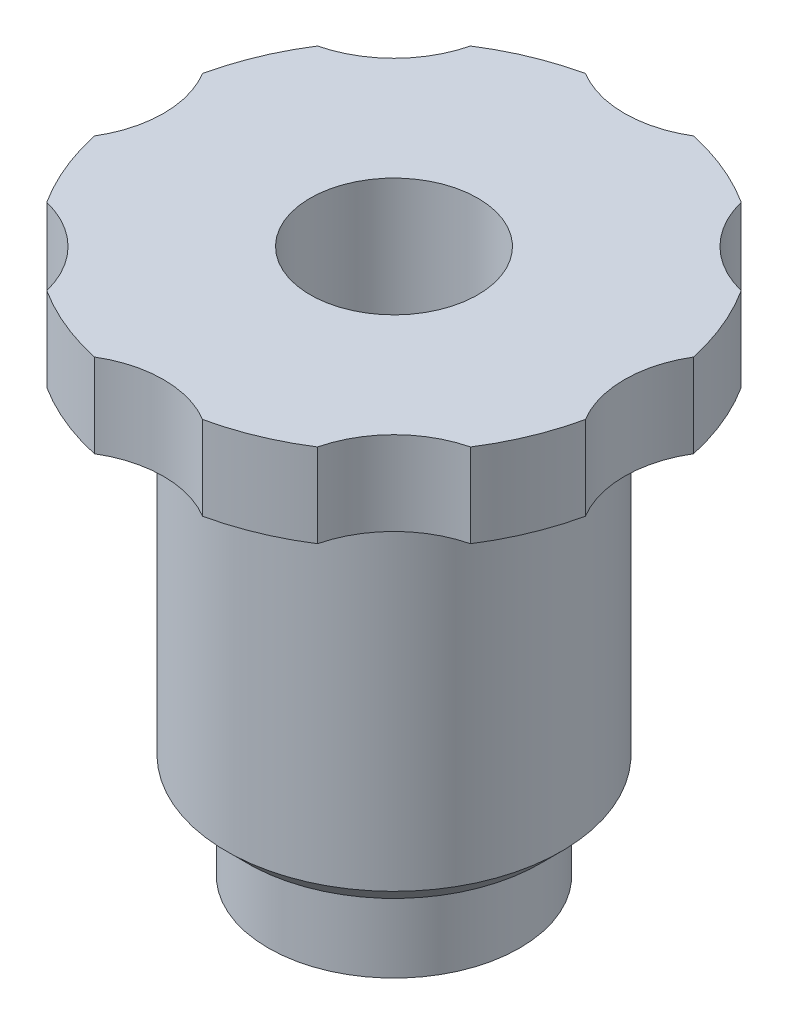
ISO-10303-21;
HEADER;
FILE_DESCRIPTION(('STEP AP214'),'2;1');
FILE_NAME('part.step','',(''),(''),'','','');
FILE_SCHEMA(('AUTOMOTIVE_DESIGN { 1 0 10303 214 1 1 1 1 }'));
ENDSEC;
DATA;
#1=APPLICATION_CONTEXT('core data for automotive mechanical design processes');
#2=APPLICATION_PROTOCOL_DEFINITION('international standard','automotive_design',2000,#1);
#3=PRODUCT_CONTEXT('',#1,'mechanical');
#4=PRODUCT('Part','Part','',(#3));
#5=PRODUCT_RELATED_PRODUCT_CATEGORY('part','',(#4));
#6=PRODUCT_DEFINITION_FORMATION('','',#4);
#7=PRODUCT_DEFINITION_CONTEXT('part definition',#1,'design');
#8=PRODUCT_DEFINITION('design','',#6,#7);
#9=PRODUCT_DEFINITION_SHAPE('','',#8);
#10=(LENGTH_UNIT() NAMED_UNIT(*) SI_UNIT(.MILLI.,.METRE.));
#11=(NAMED_UNIT(*) PLANE_ANGLE_UNIT() SI_UNIT($,.RADIAN.));
#12=(NAMED_UNIT(*) SI_UNIT($,.STERADIAN.) SOLID_ANGLE_UNIT());
#13=UNCERTAINTY_MEASURE_WITH_UNIT(LENGTH_MEASURE(1.E-05),#10,'distance_accuracy_value','');
#14=(GEOMETRIC_REPRESENTATION_CONTEXT(3) GLOBAL_UNCERTAINTY_ASSIGNED_CONTEXT((#13)) GLOBAL_UNIT_ASSIGNED_CONTEXT((#10,
#11,#12)) REPRESENTATION_CONTEXT('',''));
#15=CARTESIAN_POINT('',(0.,0.,0.));
#16=DIRECTION('',(0.,0.,1.));
#17=DIRECTION('',(1.,0.,0.));
#18=AXIS2_PLACEMENT_3D('',#15,#16,#17);
#19=CARTESIAN_POINT('',(0.,0.,0.));
#20=DIRECTION('',(0.,-1.,0.));
#21=DIRECTION('',(0.,0.,-1.));
#22=AXIS2_PLACEMENT_3D('',#19,#20,#21);
#23=CYLINDRICAL_SURFACE('',#22,6.);
#24=DIRECTION('',(0.,1.,0.));
#25=VECTOR('',#24,1.);
#26=CARTESIAN_POINT('',(5.05636440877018,6.49999999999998,-3.23004318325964));
#27=LINE('',#26,#25);
#28=CARTESIAN_POINT('',(5.05636440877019,13.,-3.23004318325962));
#29=VERTEX_POINT('',#28);
#30=CARTESIAN_POINT('',(5.05636440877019,11.,-3.23004318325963));
#31=VERTEX_POINT('',#30);
#32=EDGE_CURVE('E145',#29,#31,#27,.F.);
#33=ORIENTED_EDGE('',*,*,#32,.F.);
#34=CARTESIAN_POINT('',(0.,13.0000000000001,0.));
#35=DIRECTION('',(0.,-1.,0.));
#36=DIRECTION('',(0.,0.,-1.));
#37=AXIS2_PLACEMENT_3D('',#34,#35,#36);
#38=CIRCLE('',#37,6.);
#39=CARTESIAN_POINT('',(5.85937499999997,13.,-1.29140412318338));
#40=VERTEX_POINT('',#39);
#41=EDGE_CURVE('E156',#29,#40,#38,.T.);
#42=ORIENTED_EDGE('',*,*,#41,.T.);
#43=DIRECTION('',(0.,1.,0.));
#44=VECTOR('',#43,1.);
#45=CARTESIAN_POINT('',(5.859375,6.49999999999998,-1.29140412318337));
#46=LINE('',#45,#44);
#47=CARTESIAN_POINT('',(5.859375,11.,-1.29140412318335));
#48=VERTEX_POINT('',#47);
#49=EDGE_CURVE('E263',#48,#40,#46,.T.);
#50=ORIENTED_EDGE('',*,*,#49,.F.);
#51=CARTESIAN_POINT('',(0.,11.,0.));
#52=DIRECTION('',(0.,-1.,0.));
#53=DIRECTION('',(0.,0.,-1.));
#54=AXIS2_PLACEMENT_3D('',#51,#52,#53);
#55=CIRCLE('',#54,6.);
#56=EDGE_CURVE('E158',#31,#48,#55,.T.);
#57=ORIENTED_EDGE('',*,*,#56,.F.);
#58=EDGE_LOOP('',(#33,#42,#50,#57));
#59=FACE_BOUND('',#58,.T.);
#60=ADVANCED_FACE('F32',(#59),#23,.T.);
#61=DIRECTION('',(0.,1.,0.));
#62=VECTOR('',#61,1.);
#63=CARTESIAN_POINT('',(3.23004318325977,6.50000000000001,-5.05636440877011));
#64=LINE('',#63,#62);
#65=CARTESIAN_POINT('',(3.23004318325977,11.,-5.0563644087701));
#66=VERTEX_POINT('',#65);
#67=CARTESIAN_POINT('',(3.23004318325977,13.,-5.05636440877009));
#68=VERTEX_POINT('',#67);
#69=EDGE_CURVE('E47',#66,#68,#64,.T.);
#70=ORIENTED_EDGE('',*,*,#69,.F.);
#71=CARTESIAN_POINT('',(1.29140412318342,11.,-5.85937499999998));
#72=VERTEX_POINT('',#71);
#73=EDGE_CURVE('E180',#72,#66,#55,.T.);
#74=ORIENTED_EDGE('',*,*,#73,.F.);
#75=DIRECTION('',(0.,1.,0.));
#76=VECTOR('',#75,1.);
#77=CARTESIAN_POINT('',(1.29140412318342,6.50000000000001,-5.85937499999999));
#78=LINE('',#77,#76);
#79=CARTESIAN_POINT('',(1.29140412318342,13.,-5.85937499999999));
#80=VERTEX_POINT('',#79);
#81=EDGE_CURVE('E222',#80,#72,#78,.F.);
#82=ORIENTED_EDGE('',*,*,#81,.F.);
#83=EDGE_CURVE('E166',#80,#68,#38,.T.);
#84=ORIENTED_EDGE('',*,*,#83,.T.);
#85=EDGE_LOOP('',(#70,#74,#82,#84));
#86=FACE_BOUND('',#85,.T.);
#87=ADVANCED_FACE('F325',(#86),#23,.T.);
#88=DIRECTION('',(0.,1.,0.));
#89=VECTOR('',#88,1.);
#90=CARTESIAN_POINT('',(-1.29140412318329,6.50000000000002,-5.859375));
#91=LINE('',#90,#89);
#92=CARTESIAN_POINT('',(-1.29140412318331,11.,-5.859375));
#93=VERTEX_POINT('',#92);
#94=CARTESIAN_POINT('',(-1.2914041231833,13.,-5.85937499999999));
#95=VERTEX_POINT('',#94);
#96=EDGE_CURVE('E55',#93,#95,#91,.T.);
#97=ORIENTED_EDGE('',*,*,#96,.F.);
#98=CARTESIAN_POINT('',(-3.23004318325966,11.,-5.05636440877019));
#99=VERTEX_POINT('',#98);
#100=EDGE_CURVE('E316',#99,#93,#55,.T.);
#101=ORIENTED_EDGE('',*,*,#100,.F.);
#102=DIRECTION('',(0.,1.,0.));
#103=VECTOR('',#102,1.);
#104=CARTESIAN_POINT('',(-3.23004318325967,6.50000000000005,-5.05636440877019));
#105=LINE('',#104,#103);
#106=CARTESIAN_POINT('',(-3.23004318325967,13.,-5.05636440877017));
#107=VERTEX_POINT('',#106);
#108=EDGE_CURVE('E212',#107,#99,#105,.F.);
#109=ORIENTED_EDGE('',*,*,#108,.F.);
#110=EDGE_CURVE('E170',#107,#95,#38,.T.);
#111=ORIENTED_EDGE('',*,*,#110,.T.);
#112=EDGE_LOOP('',(#97,#101,#109,#111));
#113=FACE_BOUND('',#112,.T.);
#114=ADVANCED_FACE('F209',(#113),#23,.T.);
#115=DIRECTION('',(0.,1.,0.));
#116=VECTOR('',#115,1.);
#117=CARTESIAN_POINT('',(-5.05636440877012,6.49999999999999,-3.23004318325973));
#118=LINE('',#117,#116);
#119=CARTESIAN_POINT('',(-5.05636440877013,11.,-3.23004318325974));
#120=VERTEX_POINT('',#119);
#121=CARTESIAN_POINT('',(-5.05636440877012,13.,-3.23004318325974));
#122=VERTEX_POINT('',#121);
#123=EDGE_CURVE('E227',#120,#122,#118,.T.);
#124=ORIENTED_EDGE('',*,*,#123,.F.);
#125=CARTESIAN_POINT('',(-5.85937499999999,11.0000000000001,-1.29140412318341));
#126=VERTEX_POINT('',#125);
#127=EDGE_CURVE('E312',#126,#120,#55,.T.);
#128=ORIENTED_EDGE('',*,*,#127,.F.);
#129=DIRECTION('',(0.,1.,0.));
#130=VECTOR('',#129,1.);
#131=CARTESIAN_POINT('',(-5.85937499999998,6.50000000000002,-1.29140412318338));
#132=LINE('',#131,#130);
#133=CARTESIAN_POINT('',(-5.85937499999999,13.,-1.2914041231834));
#134=VERTEX_POINT('',#133);
#135=EDGE_CURVE('E236',#134,#126,#132,.F.);
#136=ORIENTED_EDGE('',*,*,#135,.F.);
#137=EDGE_CURVE('E195',#134,#122,#38,.T.);
#138=ORIENTED_EDGE('',*,*,#137,.T.);
#139=EDGE_LOOP('',(#124,#128,#136,#138));
#140=FACE_BOUND('',#139,.T.);
#141=ADVANCED_FACE('F364',(#140),#23,.T.);
#142=DIRECTION('',(0.,1.,0.));
#143=VECTOR('',#142,1.);
#144=CARTESIAN_POINT('',(-5.85937500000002,6.50000000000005,1.29140412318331));
#145=LINE('',#144,#143);
#146=CARTESIAN_POINT('',(-5.85937500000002,11.,1.29140412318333));
#147=VERTEX_POINT('',#146);
#148=CARTESIAN_POINT('',(-5.859375,13.,1.29140412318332));
#149=VERTEX_POINT('',#148);
#150=EDGE_CURVE('E234',#147,#149,#145,.T.);
#151=ORIENTED_EDGE('',*,*,#150,.F.);
#152=CARTESIAN_POINT('',(-5.05636440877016,11.,3.23004318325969));
#153=VERTEX_POINT('',#152);
#154=EDGE_CURVE('E308',#153,#147,#55,.T.);
#155=ORIENTED_EDGE('',*,*,#154,.F.);
#156=DIRECTION('',(0.,1.,0.));
#157=VECTOR('',#156,1.);
#158=CARTESIAN_POINT('',(-5.05636440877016,6.50000000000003,3.23004318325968));
#159=LINE('',#158,#157);
#160=CARTESIAN_POINT('',(-5.05636440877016,13.0000000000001,3.23004318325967));
#161=VERTEX_POINT('',#160);
#162=EDGE_CURVE('E244',#161,#153,#159,.F.);
#163=ORIENTED_EDGE('',*,*,#162,.F.);
#164=EDGE_CURVE('E189',#161,#149,#38,.T.);
#165=ORIENTED_EDGE('',*,*,#164,.T.);
#166=EDGE_LOOP('',(#151,#155,#163,#165));
#167=FACE_BOUND('',#166,.T.);
#168=ADVANCED_FACE('F354',(#167),#23,.T.);
#169=DIRECTION('',(0.,1.,0.));
#170=VECTOR('',#169,1.);
#171=CARTESIAN_POINT('',(-3.23004318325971,6.50000000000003,5.05636440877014));
#172=LINE('',#171,#170);
#173=CARTESIAN_POINT('',(-3.23004318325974,11.0000000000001,5.05636440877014));
#174=VERTEX_POINT('',#173);
#175=CARTESIAN_POINT('',(-3.23004318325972,13.,5.05636440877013));
#176=VERTEX_POINT('',#175);
#177=EDGE_CURVE('E242',#174,#176,#172,.T.);
#178=ORIENTED_EDGE('',*,*,#177,.F.);
#179=CARTESIAN_POINT('',(-1.29140412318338,11.,5.85937499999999));
#180=VERTEX_POINT('',#179);
#181=EDGE_CURVE('E304',#180,#174,#55,.T.);
#182=ORIENTED_EDGE('',*,*,#181,.F.);
#183=DIRECTION('',(0.,1.,0.));
#184=VECTOR('',#183,1.);
#185=CARTESIAN_POINT('',(-1.29140412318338,6.50000000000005,5.859375));
#186=LINE('',#185,#184);
#187=CARTESIAN_POINT('',(-1.29140412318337,13.0000000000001,5.85937499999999));
#188=VERTEX_POINT('',#187);
#189=EDGE_CURVE('E252',#188,#180,#186,.F.);
#190=ORIENTED_EDGE('',*,*,#189,.F.);
#191=EDGE_CURVE('E183',#188,#176,#38,.T.);
#192=ORIENTED_EDGE('',*,*,#191,.T.);
#193=EDGE_LOOP('',(#178,#182,#190,#192));
#194=FACE_BOUND('',#193,.T.);
#195=ADVANCED_FACE('F351',(#194),#23,.T.);
#196=DIRECTION('',(0.,1.,0.));
#197=VECTOR('',#196,1.);
#198=CARTESIAN_POINT('',(1.29140412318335,6.50000000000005,5.85937500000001));
#199=LINE('',#198,#197);
#200=CARTESIAN_POINT('',(1.29140412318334,11.0000000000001,5.85937500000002));
#201=VERTEX_POINT('',#200);
#202=CARTESIAN_POINT('',(1.29140412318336,13.0000000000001,5.859375));
#203=VERTEX_POINT('',#202);
#204=EDGE_CURVE('E250',#201,#203,#199,.T.);
#205=ORIENTED_EDGE('',*,*,#204,.F.);
#206=CARTESIAN_POINT('',(3.2300431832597,11.,5.05636440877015));
#207=VERTEX_POINT('',#206);
#208=EDGE_CURVE('E298',#207,#201,#55,.T.);
#209=ORIENTED_EDGE('',*,*,#208,.F.);
#210=DIRECTION('',(0.,1.,0.));
#211=VECTOR('',#210,1.);
#212=CARTESIAN_POINT('',(3.23004318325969,6.50000000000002,5.05636440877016));
#213=LINE('',#212,#211);
#214=CARTESIAN_POINT('',(3.23004318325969,13.,5.05636440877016));
#215=VERTEX_POINT('',#214);
#216=EDGE_CURVE('E260',#215,#207,#213,.F.);
#217=ORIENTED_EDGE('',*,*,#216,.F.);
#218=EDGE_CURVE('E176',#215,#203,#38,.T.);
#219=ORIENTED_EDGE('',*,*,#218,.T.);
#220=EDGE_LOOP('',(#205,#209,#217,#219));
#221=FACE_BOUND('',#220,.T.);
#222=ADVANCED_FACE('F278',(#221),#23,.T.);
#223=CARTESIAN_POINT('',(0.,0.,0.));
#224=DIRECTION('',(0.,-1.,0.));
#225=DIRECTION('',(0.,0.,-1.));
#226=AXIS2_PLACEMENT_3D('',#223,#224,#225);
#227=PLANE('',#226);
#228=CARTESIAN_POINT('',(0.,0.,0.));
#229=DIRECTION('',(0.,-1.,0.));
#230=DIRECTION('',(0.,0.,-1.));
#231=AXIS2_PLACEMENT_3D('',#228,#229,#230);
#232=CIRCLE('',#231,2.);
#233=CARTESIAN_POINT('',(0.,0.,-1.99999999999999));
#234=VERTEX_POINT('',#233);
#235=EDGE_CURVE('E172',#234,#234,#232,.T.);
#236=ORIENTED_EDGE('',*,*,#235,.F.);
#237=EDGE_LOOP('',(#236));
#238=FACE_BOUND('',#237,.T.);
#239=CARTESIAN_POINT('',(0.,0.,0.));
#240=DIRECTION('',(0.,-1.,0.));
#241=DIRECTION('',(0.,0.,-1.));
#242=AXIS2_PLACEMENT_3D('',#239,#240,#241);
#243=CIRCLE('',#242,3.);
#244=CARTESIAN_POINT('',(0.,0.,-3.00000000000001));
#245=VERTEX_POINT('',#244);
#246=EDGE_CURVE('E281',#245,#245,#243,.T.);
#247=ORIENTED_EDGE('',*,*,#246,.T.);
#248=EDGE_LOOP('',(#247));
#249=FACE_BOUND('',#248,.T.);
#250=ADVANCED_FACE('F34',(#238,#249),#227,.T.);
#251=CARTESIAN_POINT('',(0.,0.,0.));
#252=DIRECTION('',(0.,-1.,0.));
#253=DIRECTION('',(0.,0.,-1.));
#254=AXIS2_PLACEMENT_3D('',#251,#252,#253);
#255=CYLINDRICAL_SURFACE('',#254,3.);
#256=CARTESIAN_POINT('',(0.,2.00000000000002,0.));
#257=DIRECTION('',(0.,-1.,0.));
#258=DIRECTION('',(0.,0.,-1.));
#259=AXIS2_PLACEMENT_3D('',#256,#257,#258);
#260=CIRCLE('',#259,3.);
#261=CARTESIAN_POINT('',(0.,2.00000000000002,-3.00000000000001));
#262=VERTEX_POINT('',#261);
#263=EDGE_CURVE('E283',#262,#262,#260,.T.);
#264=CARTESIAN_POINT('',(0.,2.00000000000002,-3.00000000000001));
#265=CARTESIAN_POINT('',(0.,1.97916666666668,-3.00000000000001));
#266=CARTESIAN_POINT('',(0.,1.95833333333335,-3.00000000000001));
#267=CARTESIAN_POINT('',(0.,1.91666666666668,-3.00000000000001));
#268=CARTESIAN_POINT('',(0.,1.89583333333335,-3.00000000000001));
#269=CARTESIAN_POINT('',(0.,1.85416666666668,-3.00000000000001));
#270=CARTESIAN_POINT('',(0.,1.83333333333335,-3.00000000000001));
#271=CARTESIAN_POINT('',(0.,1.79166666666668,-3.00000000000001));
#272=CARTESIAN_POINT('',(0.,1.77083333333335,-3.00000000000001));
#273=CARTESIAN_POINT('',(0.,1.72916666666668,-3.00000000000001));
#274=CARTESIAN_POINT('',(0.,1.70833333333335,-3.00000000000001));
#275=CARTESIAN_POINT('',(0.,1.66666666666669,-3.00000000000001));
#276=CARTESIAN_POINT('',(0.,1.64583333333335,-3.00000000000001));
#277=CARTESIAN_POINT('',(0.,1.60416666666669,-3.00000000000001));
#278=CARTESIAN_POINT('',(0.,1.58333333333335,-3.00000000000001));
#279=CARTESIAN_POINT('',(0.,1.54166666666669,-3.00000000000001));
#280=CARTESIAN_POINT('',(0.,1.52083333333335,-3.00000000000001));
#281=CARTESIAN_POINT('',(0.,1.47916666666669,-3.00000000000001));
#282=CARTESIAN_POINT('',(0.,1.45833333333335,-3.00000000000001));
#283=CARTESIAN_POINT('',(0.,1.41666666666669,-3.00000000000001));
#284=CARTESIAN_POINT('',(0.,1.39583333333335,-3.00000000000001));
#285=CARTESIAN_POINT('',(0.,1.35416666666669,-3.00000000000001));
#286=CARTESIAN_POINT('',(0.,1.33333333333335,-3.00000000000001));
#287=CARTESIAN_POINT('',(0.,1.29166666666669,-3.00000000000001));
#288=CARTESIAN_POINT('',(0.,1.27083333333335,-3.00000000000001));
#289=CARTESIAN_POINT('',(0.,1.22916666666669,-3.00000000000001));
#290=CARTESIAN_POINT('',(0.,1.20833333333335,-3.00000000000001));
#291=CARTESIAN_POINT('',(0.,1.16666666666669,-3.00000000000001));
#292=CARTESIAN_POINT('',(0.,1.14583333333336,-3.00000000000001));
#293=CARTESIAN_POINT('',(0.,1.10416666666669,-3.00000000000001));
#294=CARTESIAN_POINT('',(0.,1.08333333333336,-3.00000000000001));
#295=CARTESIAN_POINT('',(0.,1.04166666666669,-3.00000000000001));
#296=CARTESIAN_POINT('',(0.,1.02083333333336,-3.00000000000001));
#297=CARTESIAN_POINT('',(0.,0.979166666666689,-3.00000000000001));
#298=CARTESIAN_POINT('',(0.,0.958333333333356,-3.00000000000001));
#299=CARTESIAN_POINT('',(0.,0.91666666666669,-3.00000000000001));
#300=CARTESIAN_POINT('',(0.,0.895833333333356,-3.00000000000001));
#301=CARTESIAN_POINT('',(0.,0.85416666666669,-3.00000000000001));
#302=CARTESIAN_POINT('',(0.,0.833333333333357,-3.00000000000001));
#303=CARTESIAN_POINT('',(0.,0.79166666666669,-3.00000000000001));
#304=CARTESIAN_POINT('',(0.,0.770833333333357,-3.00000000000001));
#305=CARTESIAN_POINT('',(0.,0.729166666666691,-3.00000000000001));
#306=CARTESIAN_POINT('',(0.,0.708333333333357,-3.00000000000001));
#307=CARTESIAN_POINT('',(0.,0.666666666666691,-3.00000000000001));
#308=CARTESIAN_POINT('',(0.,0.645833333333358,-3.00000000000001));
#309=CARTESIAN_POINT('',(0.,0.604166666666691,-3.00000000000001));
#310=CARTESIAN_POINT('',(0.,0.583333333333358,-3.00000000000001));
#311=CARTESIAN_POINT('',(0.,0.541666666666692,-3.00000000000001));
#312=CARTESIAN_POINT('',(0.,0.520833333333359,-3.00000000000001));
#313=CARTESIAN_POINT('',(0.,0.479166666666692,-3.00000000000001));
#314=CARTESIAN_POINT('',(0.,0.458333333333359,-3.00000000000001));
#315=CARTESIAN_POINT('',(0.,0.416666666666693,-3.00000000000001));
#316=CARTESIAN_POINT('',(0.,0.395833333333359,-3.00000000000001));
#317=CARTESIAN_POINT('',(0.,0.354166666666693,-3.00000000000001));
#318=CARTESIAN_POINT('',(0.,0.33333333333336,-3.00000000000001));
#319=CARTESIAN_POINT('',(0.,0.291666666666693,-3.00000000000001));
#320=CARTESIAN_POINT('',(0.,0.27083333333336,-3.00000000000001));
#321=CARTESIAN_POINT('',(0.,0.229166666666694,-3.00000000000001));
#322=CARTESIAN_POINT('',(0.,0.20833333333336,-3.00000000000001));
#323=CARTESIAN_POINT('',(0.,0.166666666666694,-3.00000000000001));
#324=CARTESIAN_POINT('',(0.,0.145833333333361,-3.00000000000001));
#325=CARTESIAN_POINT('',(0.,0.104166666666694,-3.00000000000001));
#326=CARTESIAN_POINT('',(0.,0.0833333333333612,-3.00000000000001));
#327=CARTESIAN_POINT('',(0.,0.0416666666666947,-3.00000000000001));
#328=CARTESIAN_POINT('',(0.,0.0208333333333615,-3.00000000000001));
#329=CARTESIAN_POINT('',(0.,0.,-3.00000000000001));
#330=B_SPLINE_CURVE_WITH_KNOTS('',3,(#264,#265,#266,#267,#268,#269,#270,#271,#272,#273,#274,
#275,#276,#277,#278,#279,#280,#281,#282,#283,#284,#285,#286,#287,#288,#289,#290,#291,#292,#293,
#294,#295,#296,#297,#298,#299,#300,#301,#302,#303,#304,#305,#306,#307,#308,#309,#310,#311,#312,
#313,#314,#315,#316,#317,#318,#319,#320,#321,#322,#323,#324,#325,#326,#327,#328,#329),
.UNSPECIFIED.,.F.,.F.,(4,2,2,2,2,2,2,2,2,2,2,2,2,2,2,2,2,2,2,2,2,2,2,2,2,2,2,2,2,2,2,2,4),(0.,
0.0624999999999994,0.124999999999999,0.187499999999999,0.249999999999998,0.312499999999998,
0.374999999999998,0.437499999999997,0.499999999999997,0.562499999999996,0.624999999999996,
0.687499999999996,0.749999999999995,0.812499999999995,0.874999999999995,0.937499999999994,
0.999999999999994,1.06249999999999,1.12499999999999,1.18749999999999,1.24999999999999,
1.31249999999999,1.37499999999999,1.43749999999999,1.49999999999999,1.56249999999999,
1.62499999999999,1.68749999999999,1.74999999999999,1.81249999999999,1.87499999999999,
1.93749999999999,1.99999999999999),.UNSPECIFIED.);
#331=EDGE_CURVE('BSEAM277',#262,#245,#330,.T.);
#332=ORIENTED_EDGE('',*,*,#263,.T.);
#333=ORIENTED_EDGE('',*,*,#246,.F.);
#334=ORIENTED_EDGE('',*,*,#331,.T.);
#335=ORIENTED_EDGE('',*,*,#331,.F.);
#336=EDGE_LOOP('',(#332,#334,#333,#335));
#337=FACE_BOUND('',#336,.T.);
#338=ADVANCED_FACE('F277',(#337),#255,.T.);
#339=CARTESIAN_POINT('',(2.99999999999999,2.,0.));
#340=DIRECTION('',(0.,-1.,0.));
#341=DIRECTION('',(0.,0.,-1.));
#342=AXIS2_PLACEMENT_3D('',#339,#340,#341);
#343=PLANE('',#342);
#344=CARTESIAN_POINT('',(0.,2.00000000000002,0.));
#345=DIRECTION('',(0.,-1.,0.));
#346=DIRECTION('',(0.,0.,-1.));
#347=AXIS2_PLACEMENT_3D('',#344,#345,#346);
#348=CIRCLE('',#347,3.5);
#349=CARTESIAN_POINT('',(0.,2.00000000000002,-3.5));
#350=VERTEX_POINT('',#349);
#351=EDGE_CURVE('E40',#350,#350,#348,.T.);
#352=ORIENTED_EDGE('',*,*,#351,.T.);
#353=EDGE_LOOP('',(#352));
#354=FACE_BOUND('',#353,.T.);
#355=ORIENTED_EDGE('',*,*,#263,.F.);
#356=EDGE_LOOP('',(#355));
#357=FACE_BOUND('',#356,.T.);
#358=ADVANCED_FACE('F465',(#354,#357),#343,.T.);
#359=CARTESIAN_POINT('',(0.,0.,0.));
#360=DIRECTION('',(0.,-1.,0.));
#361=DIRECTION('',(0.,0.,-1.));
#362=AXIS2_PLACEMENT_3D('',#359,#360,#361);
#363=CYLINDRICAL_SURFACE('',#362,4.);
#364=CARTESIAN_POINT('',(0.,2.50000000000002,0.));
#365=DIRECTION('',(0.,-1.,0.));
#366=DIRECTION('',(0.,0.,-1.));
#367=AXIS2_PLACEMENT_3D('',#364,#365,#366);
#368=CIRCLE('',#367,4.);
#369=CARTESIAN_POINT('',(0.,2.50000000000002,-4.00000000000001));
#370=VERTEX_POINT('',#369);
#371=EDGE_CURVE('E11',#370,#370,#368,.F.);
#372=CARTESIAN_POINT('',(0.,10.,0.));
#373=DIRECTION('',(0.,-1.,0.));
#374=DIRECTION('',(0.,0.,-1.));
#375=AXIS2_PLACEMENT_3D('',#372,#373,#374);
#376=CIRCLE('',#375,4.);
#377=CARTESIAN_POINT('',(0.,10.,-4.));
#378=VERTEX_POINT('',#377);
#379=EDGE_CURVE('E287',#378,#378,#376,.T.);
#380=CARTESIAN_POINT('',(0.,2.50000000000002,-4.00000000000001));
#381=CARTESIAN_POINT('',(0.,2.57812500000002,-4.00000000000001));
#382=CARTESIAN_POINT('',(0.,2.65625000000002,-4.00000000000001));
#383=CARTESIAN_POINT('',(0.,2.81250000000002,-4.00000000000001));
#384=CARTESIAN_POINT('',(0.,2.89062500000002,-4.00000000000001));
#385=CARTESIAN_POINT('',(0.,3.04687500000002,-4.00000000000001));
#386=CARTESIAN_POINT('',(0.,3.12500000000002,-4.00000000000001));
#387=CARTESIAN_POINT('',(0.,3.28125000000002,-4.00000000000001));
#388=CARTESIAN_POINT('',(0.,3.35937500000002,-4.00000000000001));
#389=CARTESIAN_POINT('',(0.,3.51562500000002,-4.00000000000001));
#390=CARTESIAN_POINT('',(0.,3.59375000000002,-4.00000000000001));
#391=CARTESIAN_POINT('',(0.,3.75000000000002,-4.00000000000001));
#392=CARTESIAN_POINT('',(0.,3.82812500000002,-4.00000000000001));
#393=CARTESIAN_POINT('',(0.,3.98437500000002,-4.00000000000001));
#394=CARTESIAN_POINT('',(0.,4.06250000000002,-4.00000000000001));
#395=CARTESIAN_POINT('',(0.,4.21875000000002,-4.00000000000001));
#396=CARTESIAN_POINT('',(0.,4.29687500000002,-4.00000000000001));
#397=CARTESIAN_POINT('',(0.,4.45312500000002,-4.00000000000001));
#398=CARTESIAN_POINT('',(0.,4.53125000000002,-4.00000000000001));
#399=CARTESIAN_POINT('',(0.,4.68750000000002,-4.00000000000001));
#400=CARTESIAN_POINT('',(0.,4.76562500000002,-4.00000000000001));
#401=CARTESIAN_POINT('',(0.,4.92187500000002,-4.00000000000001));
#402=CARTESIAN_POINT('',(0.,5.00000000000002,-4.00000000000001));
#403=CARTESIAN_POINT('',(0.,5.15625000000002,-4.00000000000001));
#404=CARTESIAN_POINT('',(0.,5.23437500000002,-4.00000000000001));
#405=CARTESIAN_POINT('',(0.,5.39062500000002,-4.00000000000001));
#406=CARTESIAN_POINT('',(0.,5.46875000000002,-4.00000000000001));
#407=CARTESIAN_POINT('',(0.,5.62500000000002,-4.00000000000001));
#408=CARTESIAN_POINT('',(0.,5.70312500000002,-4.00000000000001));
#409=CARTESIAN_POINT('',(0.,5.85937500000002,-4.00000000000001));
#410=CARTESIAN_POINT('',(0.,5.93750000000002,-4.00000000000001));
#411=CARTESIAN_POINT('',(0.,6.09375000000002,-4.00000000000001));
#412=CARTESIAN_POINT('',(0.,6.17187500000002,-4.00000000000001));
#413=CARTESIAN_POINT('',(0.,6.32812500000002,-4.00000000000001));
#414=CARTESIAN_POINT('',(0.,6.40625000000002,-4.00000000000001));
#415=CARTESIAN_POINT('',(0.,6.56250000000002,-4.00000000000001));
#416=CARTESIAN_POINT('',(0.,6.64062500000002,-4.00000000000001));
#417=CARTESIAN_POINT('',(0.,6.79687500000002,-4.00000000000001));
#418=CARTESIAN_POINT('',(0.,6.87500000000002,-4.00000000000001));
#419=CARTESIAN_POINT('',(0.,7.03125000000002,-4.00000000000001));
#420=CARTESIAN_POINT('',(0.,7.10937500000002,-4.00000000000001));
#421=CARTESIAN_POINT('',(0.,7.26562500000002,-4.00000000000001));
#422=CARTESIAN_POINT('',(0.,7.34375000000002,-4.00000000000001));
#423=CARTESIAN_POINT('',(0.,7.50000000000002,-4.00000000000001));
#424=CARTESIAN_POINT('',(0.,7.57812500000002,-4.00000000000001));
#425=CARTESIAN_POINT('',(0.,7.73437500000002,-4.00000000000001));
#426=CARTESIAN_POINT('',(0.,7.81250000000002,-4.00000000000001));
#427=CARTESIAN_POINT('',(0.,7.96875000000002,-4.00000000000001));
#428=CARTESIAN_POINT('',(0.,8.04687500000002,-4.00000000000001));
#429=CARTESIAN_POINT('',(0.,8.20312500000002,-4.00000000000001));
#430=CARTESIAN_POINT('',(0.,8.28125000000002,-4.00000000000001));
#431=CARTESIAN_POINT('',(0.,8.43750000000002,-4.00000000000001));
#432=CARTESIAN_POINT('',(0.,8.51562500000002,-4.));
#433=CARTESIAN_POINT('',(0.,8.67187500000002,-4.));
#434=CARTESIAN_POINT('',(0.,8.75000000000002,-4.));
#435=CARTESIAN_POINT('',(0.,8.90625000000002,-4.));
#436=CARTESIAN_POINT('',(0.,8.98437500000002,-4.));
#437=CARTESIAN_POINT('',(0.,9.14062500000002,-4.));
#438=CARTESIAN_POINT('',(0.,9.21875000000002,-4.));
#439=CARTESIAN_POINT('',(0.,9.37500000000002,-4.));
#440=CARTESIAN_POINT('',(0.,9.45312500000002,-4.));
#441=CARTESIAN_POINT('',(0.,9.60937500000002,-4.));
#442=CARTESIAN_POINT('',(0.,9.68750000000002,-4.));
#443=CARTESIAN_POINT('',(0.,9.84375000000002,-4.));
#444=CARTESIAN_POINT('',(0.,9.92187500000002,-4.));
#445=CARTESIAN_POINT('',(0.,10.,-4.));
#446=B_SPLINE_CURVE_WITH_KNOTS('',3,(#380,#381,#382,#383,#384,#385,#386,#387,#388,#389,#390,
#391,#392,#393,#394,#395,#396,#397,#398,#399,#400,#401,#402,#403,#404,#405,#406,#407,#408,#409,
#410,#411,#412,#413,#414,#415,#416,#417,#418,#419,#420,#421,#422,#423,#424,#425,#426,#427,#428,
#429,#430,#431,#432,#433,#434,#435,#436,#437,#438,#439,#440,#441,#442,#443,#444,#445),
.UNSPECIFIED.,.F.,.F.,(4,2,2,2,2,2,2,2,2,2,2,2,2,2,2,2,2,2,2,2,2,2,2,2,2,2,2,2,2,2,2,2,4),(0.,
0.234375,0.46875,0.703125,0.9375,1.171875,1.40625,1.640625,1.875,2.109375,2.34375,2.578125,
2.8125,3.046875,3.28125,3.515625,3.75,3.984375,4.21875,4.453125,4.6875,4.921875,5.15625,
5.390625,5.62500000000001,5.85937500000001,6.09375000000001,6.32812500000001,6.56250000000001,
6.79687500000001,7.03125000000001,7.26562500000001,7.50000000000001),.UNSPECIFIED.);
#447=EDGE_CURVE('BSEAM458',#370,#378,#446,.T.);
#448=ORIENTED_EDGE('',*,*,#371,.T.);
#449=ORIENTED_EDGE('',*,*,#379,.T.);
#450=ORIENTED_EDGE('',*,*,#447,.T.);
#451=ORIENTED_EDGE('',*,*,#447,.F.);
#452=EDGE_LOOP('',(#448,#450,#449,#451));
#453=FACE_BOUND('',#452,.T.);
#454=ADVANCED_FACE('F458',(#453),#363,.T.);
#455=CARTESIAN_POINT('',(4.,9.99999999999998,0.));
#456=DIRECTION('',(0.,1.,0.));
#457=DIRECTION('',(0.,0.,1.));
#458=AXIS2_PLACEMENT_3D('',#455,#456,#457);
#459=PLANE('',#458);
#460=CARTESIAN_POINT('',(0.,10.,0.));
#461=DIRECTION('',(0.,-1.,0.));
#462=DIRECTION('',(0.,0.,-1.));
#463=AXIS2_PLACEMENT_3D('',#460,#461,#462);
#464=CIRCLE('',#463,3.5);
#465=CARTESIAN_POINT('',(0.,10.,-3.5));
#466=VERTEX_POINT('',#465);
#467=EDGE_CURVE('E292',#466,#466,#464,.T.);
#468=ORIENTED_EDGE('',*,*,#467,.T.);
#469=EDGE_LOOP('',(#468));
#470=FACE_BOUND('',#469,.T.);
#471=ORIENTED_EDGE('',*,*,#379,.F.);
#472=EDGE_LOOP('',(#471));
#473=FACE_BOUND('',#472,.T.);
#474=ADVANCED_FACE('F451',(#470,#473),#459,.T.);
#475=CARTESIAN_POINT('',(0.,0.,0.));
#476=DIRECTION('',(0.,-1.,0.));
#477=DIRECTION('',(0.,0.,-1.));
#478=AXIS2_PLACEMENT_3D('',#475,#476,#477);
#479=CYLINDRICAL_SURFACE('',#478,3.5);
#480=CARTESIAN_POINT('',(0.,11.,0.));
#481=DIRECTION('',(0.,-1.,0.));
#482=DIRECTION('',(0.,0.,-1.));
#483=AXIS2_PLACEMENT_3D('',#480,#481,#482);
#484=CIRCLE('',#483,3.5);
#485=CARTESIAN_POINT('',(0.,11.,-3.5));
#486=VERTEX_POINT('',#485);
#487=EDGE_CURVE('E295',#486,#486,#484,.T.);
#488=CARTESIAN_POINT('',(0.,11.,-3.5));
#489=CARTESIAN_POINT('',(0.,10.9895833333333,-3.5));
#490=CARTESIAN_POINT('',(0.,10.9791666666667,-3.5));
#491=CARTESIAN_POINT('',(0.,10.9583333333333,-3.5));
#492=CARTESIAN_POINT('',(0.,10.9479166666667,-3.5));
#493=CARTESIAN_POINT('',(0.,10.9270833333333,-3.5));
#494=CARTESIAN_POINT('',(0.,10.9166666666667,-3.5));
#495=CARTESIAN_POINT('',(0.,10.8958333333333,-3.5));
#496=CARTESIAN_POINT('',(0.,10.8854166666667,-3.5));
#497=CARTESIAN_POINT('',(0.,10.8645833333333,-3.5));
#498=CARTESIAN_POINT('',(0.,10.8541666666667,-3.5));
#499=CARTESIAN_POINT('',(0.,10.8333333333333,-3.5));
#500=CARTESIAN_POINT('',(0.,10.8229166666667,-3.5));
#501=CARTESIAN_POINT('',(0.,10.8020833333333,-3.5));
#502=CARTESIAN_POINT('',(0.,10.7916666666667,-3.5));
#503=CARTESIAN_POINT('',(0.,10.7708333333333,-3.5));
#504=CARTESIAN_POINT('',(0.,10.7604166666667,-3.5));
#505=CARTESIAN_POINT('',(0.,10.7395833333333,-3.5));
#506=CARTESIAN_POINT('',(0.,10.7291666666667,-3.5));
#507=CARTESIAN_POINT('',(0.,10.7083333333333,-3.5));
#508=CARTESIAN_POINT('',(0.,10.6979166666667,-3.5));
#509=CARTESIAN_POINT('',(0.,10.6770833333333,-3.5));
#510=CARTESIAN_POINT('',(0.,10.6666666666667,-3.5));
#511=CARTESIAN_POINT('',(0.,10.6458333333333,-3.5));
#512=CARTESIAN_POINT('',(0.,10.6354166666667,-3.5));
#513=CARTESIAN_POINT('',(0.,10.6145833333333,-3.5));
#514=CARTESIAN_POINT('',(0.,10.6041666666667,-3.5));
#515=CARTESIAN_POINT('',(0.,10.5833333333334,-3.5));
#516=CARTESIAN_POINT('',(0.,10.5729166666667,-3.5));
#517=CARTESIAN_POINT('',(0.,10.5520833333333,-3.5));
#518=CARTESIAN_POINT('',(0.,10.5416666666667,-3.5));
#519=CARTESIAN_POINT('',(0.,10.5208333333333,-3.5));
#520=CARTESIAN_POINT('',(0.,10.5104166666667,-3.5));
#521=CARTESIAN_POINT('',(0.,10.4895833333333,-3.5));
#522=CARTESIAN_POINT('',(0.,10.4791666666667,-3.5));
#523=CARTESIAN_POINT('',(0.,10.4583333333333,-3.5));
#524=CARTESIAN_POINT('',(0.,10.4479166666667,-3.5));
#525=CARTESIAN_POINT('',(0.,10.4270833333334,-3.5));
#526=CARTESIAN_POINT('',(0.,10.4166666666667,-3.5));
#527=CARTESIAN_POINT('',(0.,10.3958333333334,-3.5));
#528=CARTESIAN_POINT('',(0.,10.3854166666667,-3.5));
#529=CARTESIAN_POINT('',(0.,10.3645833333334,-3.5));
#530=CARTESIAN_POINT('',(0.,10.3541666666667,-3.5));
#531=CARTESIAN_POINT('',(0.,10.3333333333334,-3.5));
#532=CARTESIAN_POINT('',(0.,10.3229166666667,-3.5));
#533=CARTESIAN_POINT('',(0.,10.3020833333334,-3.5));
#534=CARTESIAN_POINT('',(0.,10.2916666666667,-3.5));
#535=CARTESIAN_POINT('',(0.,10.2708333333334,-3.5));
#536=CARTESIAN_POINT('',(0.,10.2604166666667,-3.5));
#537=CARTESIAN_POINT('',(0.,10.2395833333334,-3.5));
#538=CARTESIAN_POINT('',(0.,10.2291666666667,-3.5));
#539=CARTESIAN_POINT('',(0.,10.2083333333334,-3.5));
#540=CARTESIAN_POINT('',(0.,10.1979166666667,-3.5));
#541=CARTESIAN_POINT('',(0.,10.1770833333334,-3.5));
#542=CARTESIAN_POINT('',(0.,10.1666666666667,-3.5));
#543=CARTESIAN_POINT('',(0.,10.1458333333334,-3.5));
#544=CARTESIAN_POINT('',(0.,10.1354166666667,-3.5));
#545=CARTESIAN_POINT('',(0.,10.1145833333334,-3.5));
#546=CARTESIAN_POINT('',(0.,10.1041666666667,-3.5));
#547=CARTESIAN_POINT('',(0.,10.0833333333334,-3.5));
#548=CARTESIAN_POINT('',(0.,10.0729166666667,-3.5));
#549=CARTESIAN_POINT('',(0.,10.0520833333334,-3.5));
#550=CARTESIAN_POINT('',(0.,10.0416666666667,-3.5));
#551=CARTESIAN_POINT('',(0.,10.0208333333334,-3.5));
#552=CARTESIAN_POINT('',(0.,10.0104166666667,-3.5));
#553=CARTESIAN_POINT('',(0.,10.,-3.5));
#554=B_SPLINE_CURVE_WITH_KNOTS('',3,(#488,#489,#490,#491,#492,#493,#494,#495,#496,#497,#498,
#499,#500,#501,#502,#503,#504,#505,#506,#507,#508,#509,#510,#511,#512,#513,#514,#515,#516,#517,
#518,#519,#520,#521,#522,#523,#524,#525,#526,#527,#528,#529,#530,#531,#532,#533,#534,#535,#536,
#537,#538,#539,#540,#541,#542,#543,#544,#545,#546,#547,#548,#549,#550,#551,#552,#553),
.UNSPECIFIED.,.F.,.F.,(4,2,2,2,2,2,2,2,2,2,2,2,2,2,2,2,2,2,2,2,2,2,2,2,2,2,2,2,2,2,2,2,4),(0.,
0.03125,0.0625000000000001,0.0937499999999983,0.124999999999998,0.156249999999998,
0.187499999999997,0.218749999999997,0.249999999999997,0.281249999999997,0.312499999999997,
0.343749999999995,0.374999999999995,0.406249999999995,0.437499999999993,0.468749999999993,
0.499999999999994,0.531249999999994,0.562499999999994,0.593749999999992,0.624999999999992,
0.656249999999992,0.68749999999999,0.71874999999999,0.74999999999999,0.78124999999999,
0.81249999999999,0.843749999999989,0.874999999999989,0.906249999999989,0.937499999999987,
0.968749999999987,0.999999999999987),.UNSPECIFIED.);
#555=EDGE_CURVE('BSEAM349',#486,#466,#554,.T.);
#556=ORIENTED_EDGE('',*,*,#487,.T.);
#557=ORIENTED_EDGE('',*,*,#467,.F.);
#558=ORIENTED_EDGE('',*,*,#555,.T.);
#559=ORIENTED_EDGE('',*,*,#555,.F.);
#560=EDGE_LOOP('',(#556,#558,#557,#559));
#561=FACE_BOUND('',#560,.T.);
#562=ADVANCED_FACE('F349',(#561),#479,.T.);
#563=CARTESIAN_POINT('',(3.5,11.,0.));
#564=DIRECTION('',(0.,-1.,0.));
#565=DIRECTION('',(0.,0.,-1.));
#566=AXIS2_PLACEMENT_3D('',#563,#564,#565);
#567=PLANE('',#566);
#568=CARTESIAN_POINT('',(5.65685424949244,11.,-5.65685424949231));
#569=DIRECTION('',(0.,-1.,0.));
#570=DIRECTION('',(0.,0.,-1.));
#571=AXIS2_PLACEMENT_3D('',#568,#569,#570);
#572=CIRCLE('',#571,2.5);
#573=EDGE_CURVE('E151',#31,#66,#572,.T.);
#574=ORIENTED_EDGE('',*,*,#573,.F.);
#575=ORIENTED_EDGE('',*,*,#56,.T.);
#576=CARTESIAN_POINT('',(7.99999999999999,11.,0.));
#577=DIRECTION('',(0.,-1.,0.));
#578=DIRECTION('',(0.,0.,-1.));
#579=AXIS2_PLACEMENT_3D('',#576,#577,#578);
#580=CIRCLE('',#579,2.5);
#581=CARTESIAN_POINT('',(5.85937500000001,11.,1.29140412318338));
#582=VERTEX_POINT('',#581);
#583=EDGE_CURVE('E265',#582,#48,#580,.T.);
#584=ORIENTED_EDGE('',*,*,#583,.F.);
#585=CARTESIAN_POINT('',(5.05636440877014,11.,3.23004318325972));
#586=VERTEX_POINT('',#585);
#587=EDGE_CURVE('E181',#582,#586,#55,.T.);
#588=ORIENTED_EDGE('',*,*,#587,.T.);
#589=CARTESIAN_POINT('',(5.65685424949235,11.,5.65685424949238));
#590=DIRECTION('',(0.,-1.,0.));
#591=DIRECTION('',(0.,0.,-1.));
#592=AXIS2_PLACEMENT_3D('',#589,#590,#591);
#593=CIRCLE('',#592,2.5);
#594=EDGE_CURVE('E258',#207,#586,#593,.T.);
#595=ORIENTED_EDGE('',*,*,#594,.F.);
#596=ORIENTED_EDGE('',*,*,#208,.T.);
#597=CARTESIAN_POINT('',(0.,11.,8.00000000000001));
#598=DIRECTION('',(0.,-1.,0.));
#599=DIRECTION('',(0.,0.,-1.));
#600=AXIS2_PLACEMENT_3D('',#597,#598,#599);
#601=CIRCLE('',#600,2.5);
#602=EDGE_CURVE('E248',#180,#201,#601,.T.);
#603=ORIENTED_EDGE('',*,*,#602,.F.);
#604=ORIENTED_EDGE('',*,*,#181,.T.);
#605=CARTESIAN_POINT('',(-5.65685424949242,11.,5.65685424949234));
#606=DIRECTION('',(0.,-1.,0.));
#607=DIRECTION('',(0.,0.,-1.));
#608=AXIS2_PLACEMENT_3D('',#605,#606,#607);
#609=CIRCLE('',#608,2.5);
#610=EDGE_CURVE('E240',#153,#174,#609,.T.);
#611=ORIENTED_EDGE('',*,*,#610,.F.);
#612=ORIENTED_EDGE('',*,*,#154,.T.);
#613=CARTESIAN_POINT('',(-7.99999999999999,11.,0.));
#614=DIRECTION('',(0.,-1.,0.));
#615=DIRECTION('',(0.,0.,-1.));
#616=AXIS2_PLACEMENT_3D('',#613,#614,#615);
#617=CIRCLE('',#616,2.5);
#618=EDGE_CURVE('E232',#126,#147,#617,.T.);
#619=ORIENTED_EDGE('',*,*,#618,.F.);
#620=ORIENTED_EDGE('',*,*,#127,.T.);
#621=CARTESIAN_POINT('',(-5.65685424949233,11.,-5.65685424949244));
#622=DIRECTION('',(0.,-1.,0.));
#623=DIRECTION('',(0.,0.,-1.));
#624=AXIS2_PLACEMENT_3D('',#621,#622,#623);
#625=CIRCLE('',#624,2.5);
#626=EDGE_CURVE('E225',#99,#120,#625,.T.);
#627=ORIENTED_EDGE('',*,*,#626,.F.);
#628=ORIENTED_EDGE('',*,*,#100,.T.);
#629=CARTESIAN_POINT('',(0.,11.,-7.99999999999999));
#630=DIRECTION('',(0.,-1.,0.));
#631=DIRECTION('',(0.,0.,-1.));
#632=AXIS2_PLACEMENT_3D('',#629,#630,#631);
#633=CIRCLE('',#632,2.5);
#634=EDGE_CURVE('E216',#72,#93,#633,.T.);
#635=ORIENTED_EDGE('',*,*,#634,.F.);
#636=ORIENTED_EDGE('',*,*,#73,.T.);
#637=EDGE_LOOP('',(#574,#575,#584,#588,#595,#596,#603,#604,#611,#612,#619,#620,#627,#628,#635,#636));
#638=FACE_BOUND('',#637,.T.);
#639=ORIENTED_EDGE('',*,*,#487,.F.);
#640=EDGE_LOOP('',(#639));
#641=FACE_BOUND('',#640,.T.);
#642=ADVANCED_FACE('F322',(#638,#641),#567,.T.);
#643=DIRECTION('',(0.,1.,0.));
#644=VECTOR('',#643,1.);
#645=CARTESIAN_POINT('',(5.05636440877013,6.49999999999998,3.23004318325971));
#646=LINE('',#645,#644);
#647=CARTESIAN_POINT('',(5.05636440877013,13.,3.23004318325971));
#648=VERTEX_POINT('',#647);
#649=EDGE_CURVE('E256',#586,#648,#646,.T.);
#650=ORIENTED_EDGE('',*,*,#649,.F.);
#651=ORIENTED_EDGE('',*,*,#587,.F.);
#652=DIRECTION('',(0.,1.,0.));
#653=VECTOR('',#652,1.);
#654=CARTESIAN_POINT('',(5.85937499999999,6.49999999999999,1.29140412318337));
#655=LINE('',#654,#653);
#656=CARTESIAN_POINT('',(5.85937499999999,13.,1.29140412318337));
#657=VERTEX_POINT('',#656);
#658=EDGE_CURVE('E268',#657,#582,#655,.F.);
#659=ORIENTED_EDGE('',*,*,#658,.F.);
#660=EDGE_CURVE('E169',#657,#648,#38,.T.);
#661=ORIENTED_EDGE('',*,*,#660,.T.);
#662=EDGE_LOOP('',(#650,#651,#659,#661));
#663=FACE_BOUND('',#662,.T.);
#664=ADVANCED_FACE('F340',(#663),#23,.T.);
#665=CARTESIAN_POINT('',(6.,13.,0.));
#666=DIRECTION('',(0.,1.,0.));
#667=DIRECTION('',(0.,0.,1.));
#668=AXIS2_PLACEMENT_3D('',#665,#666,#667);
#669=PLANE('',#668);
#670=CARTESIAN_POINT('',(5.65685424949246,13.,-5.6568542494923));
#671=DIRECTION('',(0.,1.,0.));
#672=DIRECTION('',(0.707106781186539,0.,0.707106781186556));
#673=AXIS2_PLACEMENT_3D('',#670,#671,#672);
#674=CIRCLE('',#673,2.5);
#675=EDGE_CURVE('E142',#68,#29,#674,.T.);
#676=ORIENTED_EDGE('',*,*,#675,.F.);
#677=ORIENTED_EDGE('',*,*,#83,.F.);
#678=CARTESIAN_POINT('',(0.,13.,-8.));
#679=DIRECTION('',(0.,1.,0.));
#680=DIRECTION('',(0.999999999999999,0.,0.));
#681=AXIS2_PLACEMENT_3D('',#678,#679,#680);
#682=CIRCLE('',#681,2.5);
#683=EDGE_CURVE('E159',#95,#80,#682,.T.);
#684=ORIENTED_EDGE('',*,*,#683,.F.);
#685=ORIENTED_EDGE('',*,*,#110,.F.);
#686=CARTESIAN_POINT('',(-5.65685424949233,13.0000000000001,-5.65685424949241));
#687=DIRECTION('',(0.,1.,0.));
#688=DIRECTION('',(0.707106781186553,0.,-0.707106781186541));
#689=AXIS2_PLACEMENT_3D('',#686,#687,#688);
#690=CIRCLE('',#689,2.5);
#691=EDGE_CURVE('E214',#122,#107,#690,.T.);
#692=ORIENTED_EDGE('',*,*,#691,.F.);
#693=ORIENTED_EDGE('',*,*,#137,.F.);
#694=CARTESIAN_POINT('',(-7.99999999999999,13.,0.));
#695=DIRECTION('',(0.,1.,0.));
#696=DIRECTION('',(0.,0.,-0.999999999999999));
#697=AXIS2_PLACEMENT_3D('',#694,#695,#696);
#698=CIRCLE('',#697,2.5);
#699=EDGE_CURVE('E230',#149,#134,#698,.T.);
#700=ORIENTED_EDGE('',*,*,#699,.F.);
#701=ORIENTED_EDGE('',*,*,#164,.F.);
#702=CARTESIAN_POINT('',(-5.65685424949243,13.0000000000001,5.65685424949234));
#703=DIRECTION('',(0.,1.,0.));
#704=DIRECTION('',(-0.707106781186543,0.,-0.707106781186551));
#705=AXIS2_PLACEMENT_3D('',#702,#703,#704);
#706=CIRCLE('',#705,2.5);
#707=EDGE_CURVE('E238',#176,#161,#706,.T.);
#708=ORIENTED_EDGE('',*,*,#707,.F.);
#709=ORIENTED_EDGE('',*,*,#191,.F.);
#710=CARTESIAN_POINT('',(0.,13.,7.99999999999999));
#711=DIRECTION('',(0.,1.,0.));
#712=DIRECTION('',(-0.999999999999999,0.,0.));
#713=AXIS2_PLACEMENT_3D('',#710,#711,#712);
#714=CIRCLE('',#713,2.5);
#715=EDGE_CURVE('E246',#203,#188,#714,.T.);
#716=ORIENTED_EDGE('',*,*,#715,.F.);
#717=ORIENTED_EDGE('',*,*,#218,.F.);
#718=CARTESIAN_POINT('',(5.65685424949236,13.,5.65685424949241));
#719=DIRECTION('',(0.,1.,0.));
#720=DIRECTION('',(-0.707106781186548,0.,0.707106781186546));
#721=AXIS2_PLACEMENT_3D('',#718,#719,#720);
#722=CIRCLE('',#721,2.5);
#723=EDGE_CURVE('E254',#648,#215,#722,.T.);
#724=ORIENTED_EDGE('',*,*,#723,.F.);
#725=ORIENTED_EDGE('',*,*,#660,.F.);
#726=CARTESIAN_POINT('',(8.00000000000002,13.,0.));
#727=DIRECTION('',(0.,1.,0.));
#728=DIRECTION('',(0.,0.,1.));
#729=AXIS2_PLACEMENT_3D('',#726,#727,#728);
#730=CIRCLE('',#729,2.5);
#731=EDGE_CURVE('E165',#40,#657,#730,.T.);
#732=ORIENTED_EDGE('',*,*,#731,.F.);
#733=ORIENTED_EDGE('',*,*,#41,.F.);
#734=EDGE_LOOP('',(#676,#677,#684,#685,#692,#693,#700,#701,#708,#709,#716,#717,#724,#725,#732,#733));
#735=FACE_BOUND('',#734,.T.);
#736=CARTESIAN_POINT('',(0.,13.0000000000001,0.));
#737=DIRECTION('',(0.,-1.,0.));
#738=DIRECTION('',(0.,0.,-1.));
#739=AXIS2_PLACEMENT_3D('',#736,#737,#738);
#740=CIRCLE('',#739,2.);
#741=CARTESIAN_POINT('',(0.,13.0000000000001,-1.99999999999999));
#742=VERTEX_POINT('',#741);
#743=EDGE_CURVE('E167',#742,#742,#740,.T.);
#744=ORIENTED_EDGE('',*,*,#743,.T.);
#745=EDGE_LOOP('',(#744));
#746=FACE_BOUND('',#745,.T.);
#747=ADVANCED_FACE('F162',(#735,#746),#669,.T.);
#748=CARTESIAN_POINT('',(0.,13.0000000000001,0.));
#749=DIRECTION('',(0.,-1.,0.));
#750=DIRECTION('',(0.,0.,-1.));
#751=AXIS2_PLACEMENT_3D('',#748,#749,#750);
#752=CYLINDRICAL_SURFACE('',#751,2.);
#753=CARTESIAN_POINT('',(0.,13.0000000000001,-1.99999999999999));
#754=CARTESIAN_POINT('',(0.,12.8645833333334,-1.99999999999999));
#755=CARTESIAN_POINT('',(0.,12.7291666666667,-1.99999999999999));
#756=CARTESIAN_POINT('',(0.,12.4583333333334,-1.99999999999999));
#757=CARTESIAN_POINT('',(0.,12.3229166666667,-1.99999999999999));
#758=CARTESIAN_POINT('',(0.,12.0520833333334,-1.99999999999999));
#759=CARTESIAN_POINT('',(0.,11.9166666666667,-1.99999999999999));
#760=CARTESIAN_POINT('',(0.,11.6458333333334,-1.99999999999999));
#761=CARTESIAN_POINT('',(0.,11.5104166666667,-1.99999999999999));
#762=CARTESIAN_POINT('',(0.,11.2395833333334,-1.99999999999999));
#763=CARTESIAN_POINT('',(0.,11.1041666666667,-1.99999999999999));
#764=CARTESIAN_POINT('',(0.,10.8333333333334,-1.99999999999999));
#765=CARTESIAN_POINT('',(0.,10.6979166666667,-1.99999999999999));
#766=CARTESIAN_POINT('',(0.,10.4270833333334,-1.99999999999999));
#767=CARTESIAN_POINT('',(0.,10.2916666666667,-1.99999999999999));
#768=CARTESIAN_POINT('',(0.,10.0208333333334,-1.99999999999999));
#769=CARTESIAN_POINT('',(0.,9.88541666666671,-1.99999999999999));
#770=CARTESIAN_POINT('',(0.,9.61458333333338,-1.99999999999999));
#771=CARTESIAN_POINT('',(0.,9.47916666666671,-1.99999999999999));
#772=CARTESIAN_POINT('',(0.,9.20833333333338,-1.99999999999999));
#773=CARTESIAN_POINT('',(0.,9.07291666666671,-1.99999999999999));
#774=CARTESIAN_POINT('',(0.,8.80208333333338,-1.99999999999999));
#775=CARTESIAN_POINT('',(0.,8.66666666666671,-1.99999999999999));
#776=CARTESIAN_POINT('',(0.,8.39583333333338,-1.99999999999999));
#777=CARTESIAN_POINT('',(0.,8.26041666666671,-1.99999999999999));
#778=CARTESIAN_POINT('',(0.,7.98958333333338,-1.99999999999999));
#779=CARTESIAN_POINT('',(0.,7.85416666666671,-1.99999999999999));
#780=CARTESIAN_POINT('',(0.,7.58333333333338,-1.99999999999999));
#781=CARTESIAN_POINT('',(0.,7.44791666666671,-1.99999999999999));
#782=CARTESIAN_POINT('',(0.,7.17708333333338,-1.99999999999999));
#783=CARTESIAN_POINT('',(0.,7.04166666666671,-1.99999999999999));
#784=CARTESIAN_POINT('',(0.,6.77083333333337,-1.99999999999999));
#785=CARTESIAN_POINT('',(0.,6.63541666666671,-1.99999999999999));
#786=CARTESIAN_POINT('',(0.,6.36458333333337,-1.99999999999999));
#787=CARTESIAN_POINT('',(0.,6.22916666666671,-1.99999999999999));
#788=CARTESIAN_POINT('',(0.,5.95833333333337,-1.99999999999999));
#789=CARTESIAN_POINT('',(0.,5.82291666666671,-1.99999999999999));
#790=CARTESIAN_POINT('',(0.,5.55208333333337,-1.99999999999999));
#791=CARTESIAN_POINT('',(0.,5.41666666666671,-1.99999999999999));
#792=CARTESIAN_POINT('',(0.,5.14583333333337,-1.99999999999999));
#793=CARTESIAN_POINT('',(0.,5.01041666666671,-1.99999999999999));
#794=CARTESIAN_POINT('',(0.,4.73958333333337,-1.99999999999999));
#795=CARTESIAN_POINT('',(0.,4.60416666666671,-1.99999999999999));
#796=CARTESIAN_POINT('',(0.,4.33333333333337,-1.99999999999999));
#797=CARTESIAN_POINT('',(0.,4.1979166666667,-1.99999999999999));
#798=CARTESIAN_POINT('',(0.,3.92708333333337,-1.99999999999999));
#799=CARTESIAN_POINT('',(0.,3.7916666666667,-1.99999999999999));
#800=CARTESIAN_POINT('',(0.,3.52083333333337,-1.99999999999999));
#801=CARTESIAN_POINT('',(0.,3.3854166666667,-1.99999999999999));
#802=CARTESIAN_POINT('',(0.,3.11458333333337,-1.99999999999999));
#803=CARTESIAN_POINT('',(0.,2.9791666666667,-1.99999999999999));
#804=CARTESIAN_POINT('',(0.,2.70833333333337,-1.99999999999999));
#805=CARTESIAN_POINT('',(0.,2.5729166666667,-1.99999999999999));
#806=CARTESIAN_POINT('',(0.,2.30208333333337,-1.99999999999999));
#807=CARTESIAN_POINT('',(0.,2.1666666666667,-1.99999999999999));
#808=CARTESIAN_POINT('',(0.,1.89583333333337,-1.99999999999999));
#809=CARTESIAN_POINT('',(0.,1.7604166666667,-1.99999999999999));
#810=CARTESIAN_POINT('',(0.,1.48958333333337,-1.99999999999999));
#811=CARTESIAN_POINT('',(0.,1.3541666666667,-1.99999999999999));
#812=CARTESIAN_POINT('',(0.,1.08333333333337,-1.99999999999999));
#813=CARTESIAN_POINT('',(0.,0.947916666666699,-1.99999999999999));
#814=CARTESIAN_POINT('',(0.,0.677083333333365,-1.99999999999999));
#815=CARTESIAN_POINT('',(0.,0.541666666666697,-1.99999999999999));
#816=CARTESIAN_POINT('',(0.,0.270833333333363,-1.99999999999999));
#817=CARTESIAN_POINT('',(0.,0.135416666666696,-1.99999999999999));
#818=CARTESIAN_POINT('',(0.,0.,-1.99999999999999));
#819=B_SPLINE_CURVE_WITH_KNOTS('',3,(#753,#754,#755,#756,#757,#758,#759,#760,#761,#762,#763,
#764,#765,#766,#767,#768,#769,#770,#771,#772,#773,#774,#775,#776,#777,#778,#779,#780,#781,#782,
#783,#784,#785,#786,#787,#788,#789,#790,#791,#792,#793,#794,#795,#796,#797,#798,#799,#800,#801,
#802,#803,#804,#805,#806,#807,#808,#809,#810,#811,#812,#813,#814,#815,#816,#817,#818),
.UNSPECIFIED.,.F.,.F.,(4,2,2,2,2,2,2,2,2,2,2,2,2,2,2,2,2,2,2,2,2,2,2,2,2,2,2,2,2,2,2,2,4),(0.,
0.406250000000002,0.812500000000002,1.21875,1.625,2.03125000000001,2.43750000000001,
2.84375000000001,3.25000000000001,3.65625000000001,4.06250000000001,4.46875000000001,
4.87500000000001,5.28125000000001,5.68750000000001,6.09375000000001,6.50000000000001,
6.90625000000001,7.31250000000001,7.71875000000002,8.12500000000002,8.53125000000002,
8.93750000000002,9.34375000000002,9.75000000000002,10.15625,10.5625,10.96875,11.375,11.78125,
12.1875,12.59375,13.),.UNSPECIFIED.);
#820=EDGE_CURVE('BSEAM273',#742,#234,#819,.T.);
#821=ORIENTED_EDGE('',*,*,#743,.F.);
#822=ORIENTED_EDGE('',*,*,#235,.T.);
#823=ORIENTED_EDGE('',*,*,#820,.T.);
#824=ORIENTED_EDGE('',*,*,#820,.F.);
#825=EDGE_LOOP('',(#821,#823,#822,#824));
#826=FACE_BOUND('',#825,.T.);
#827=ADVANCED_FACE('F273',(#826),#752,.F.);
#828=CARTESIAN_POINT('',(0.,2.00000000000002,0.));
#829=DIRECTION('',(0.,1.,0.));
#830=DIRECTION('',(0.,0.,1.));
#831=AXIS2_PLACEMENT_3D('',#828,#829,#830);
#832=CONICAL_SURFACE('',#831,3.5,0.785398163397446);
#833=ORIENTED_EDGE('',*,*,#371,.F.);
#834=EDGE_LOOP('',(#833));
#835=FACE_BOUND('',#834,.T.);
#836=ORIENTED_EDGE('',*,*,#351,.F.);
#837=EDGE_LOOP('',(#836));
#838=FACE_BOUND('',#837,.T.);
#839=ADVANCED_FACE('F411',(#835,#838),#832,.T.);
#840=CARTESIAN_POINT('',(8.,0.,0.));
#841=DIRECTION('',(0.,1.,0.));
#842=DIRECTION('',(0.,0.,1.));
#843=AXIS2_PLACEMENT_3D('',#840,#841,#842);
#844=CYLINDRICAL_SURFACE('',#843,2.5);
#845=ORIENTED_EDGE('',*,*,#658,.T.);
#846=ORIENTED_EDGE('',*,*,#583,.T.);
#847=ORIENTED_EDGE('',*,*,#49,.T.);
#848=ORIENTED_EDGE('',*,*,#731,.T.);
#849=EDGE_LOOP('',(#845,#846,#847,#848));
#850=FACE_BOUND('',#849,.T.);
#851=ADVANCED_FACE('F383',(#850),#844,.F.);
#852=CARTESIAN_POINT('',(5.65685424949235,0.,5.65685424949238));
#853=DIRECTION('',(0.,1.,0.));
#854=DIRECTION('',(0.,0.,1.));
#855=AXIS2_PLACEMENT_3D('',#852,#853,#854);
#856=CYLINDRICAL_SURFACE('',#855,2.5);
#857=ORIENTED_EDGE('',*,*,#216,.T.);
#858=ORIENTED_EDGE('',*,*,#594,.T.);
#859=ORIENTED_EDGE('',*,*,#649,.T.);
#860=ORIENTED_EDGE('',*,*,#723,.T.);
#861=EDGE_LOOP('',(#857,#858,#859,#860));
#862=FACE_BOUND('',#861,.T.);
#863=ADVANCED_FACE('F378',(#862),#856,.F.);
#864=CARTESIAN_POINT('',(0.,0.,7.99999999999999));
#865=DIRECTION('',(0.,1.,0.));
#866=DIRECTION('',(0.,0.,1.));
#867=AXIS2_PLACEMENT_3D('',#864,#865,#866);
#868=CYLINDRICAL_SURFACE('',#867,2.5);
#869=ORIENTED_EDGE('',*,*,#189,.T.);
#870=ORIENTED_EDGE('',*,*,#602,.T.);
#871=ORIENTED_EDGE('',*,*,#204,.T.);
#872=ORIENTED_EDGE('',*,*,#715,.T.);
#873=EDGE_LOOP('',(#869,#870,#871,#872));
#874=FACE_BOUND('',#873,.T.);
#875=ADVANCED_FACE('F357',(#874),#868,.F.);
#876=CARTESIAN_POINT('',(-5.65685424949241,0.,5.65685424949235));
#877=DIRECTION('',(0.,1.,0.));
#878=DIRECTION('',(0.,0.,1.));
#879=AXIS2_PLACEMENT_3D('',#876,#877,#878);
#880=CYLINDRICAL_SURFACE('',#879,2.5);
#881=ORIENTED_EDGE('',*,*,#162,.T.);
#882=ORIENTED_EDGE('',*,*,#610,.T.);
#883=ORIENTED_EDGE('',*,*,#177,.T.);
#884=ORIENTED_EDGE('',*,*,#707,.T.);
#885=EDGE_LOOP('',(#881,#882,#883,#884));
#886=FACE_BOUND('',#885,.T.);
#887=ADVANCED_FACE('F362',(#886),#880,.F.);
#888=CARTESIAN_POINT('',(-7.99999999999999,0.,0.));
#889=DIRECTION('',(0.,1.,0.));
#890=DIRECTION('',(0.,0.,1.));
#891=AXIS2_PLACEMENT_3D('',#888,#889,#890);
#892=CYLINDRICAL_SURFACE('',#891,2.5);
#893=ORIENTED_EDGE('',*,*,#135,.T.);
#894=ORIENTED_EDGE('',*,*,#618,.T.);
#895=ORIENTED_EDGE('',*,*,#150,.T.);
#896=ORIENTED_EDGE('',*,*,#699,.T.);
#897=EDGE_LOOP('',(#893,#894,#895,#896));
#898=FACE_BOUND('',#897,.T.);
#899=ADVANCED_FACE('F335',(#898),#892,.F.);
#900=CARTESIAN_POINT('',(-5.65685424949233,0.,-5.65685424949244));
#901=DIRECTION('',(0.,1.,0.));
#902=DIRECTION('',(0.,0.,1.));
#903=AXIS2_PLACEMENT_3D('',#900,#901,#902);
#904=CYLINDRICAL_SURFACE('',#903,2.5);
#905=ORIENTED_EDGE('',*,*,#108,.T.);
#906=ORIENTED_EDGE('',*,*,#626,.T.);
#907=ORIENTED_EDGE('',*,*,#123,.T.);
#908=ORIENTED_EDGE('',*,*,#691,.T.);
#909=EDGE_LOOP('',(#905,#906,#907,#908));
#910=FACE_BOUND('',#909,.T.);
#911=ADVANCED_FACE('F329',(#910),#904,.F.);
#912=CARTESIAN_POINT('',(0.,0.,-8.));
#913=DIRECTION('',(0.,1.,0.));
#914=DIRECTION('',(0.,0.,1.));
#915=AXIS2_PLACEMENT_3D('',#912,#913,#914);
#916=CYLINDRICAL_SURFACE('',#915,2.5);
#917=ORIENTED_EDGE('',*,*,#81,.T.);
#918=ORIENTED_EDGE('',*,*,#634,.T.);
#919=ORIENTED_EDGE('',*,*,#96,.T.);
#920=ORIENTED_EDGE('',*,*,#683,.T.);
#921=EDGE_LOOP('',(#917,#918,#919,#920));
#922=FACE_BOUND('',#921,.T.);
#923=ADVANCED_FACE('F327',(#922),#916,.F.);
#924=CARTESIAN_POINT('',(5.65685424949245,0.,-5.65685424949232));
#925=DIRECTION('',(0.,1.,0.));
#926=DIRECTION('',(0.,0.,1.));
#927=AXIS2_PLACEMENT_3D('',#924,#925,#926);
#928=CYLINDRICAL_SURFACE('',#927,2.5);
#929=ORIENTED_EDGE('',*,*,#32,.T.);
#930=ORIENTED_EDGE('',*,*,#573,.T.);
#931=ORIENTED_EDGE('',*,*,#69,.T.);
#932=ORIENTED_EDGE('',*,*,#675,.T.);
#933=EDGE_LOOP('',(#929,#930,#931,#932));
#934=FACE_BOUND('',#933,.T.);
#935=ADVANCED_FACE('F144',(#934),#928,.F.);
#936=CLOSED_SHELL('',(#60,#87,#114,#141,#168,#195,#222,#250,#338,#358,#454,#474,#562,#642,#664,
#747,#827,#839,#851,#863,#875,#887,#899,#911,#923,#935));
#937=MANIFOLD_SOLID_BREP('B2',#936);
#938=ADVANCED_BREP_SHAPE_REPRESENTATION('',(#18,#937),#14);
#939=SHAPE_DEFINITION_REPRESENTATION(#9,#938);
ENDSEC;
END-ISO-10303-21;
